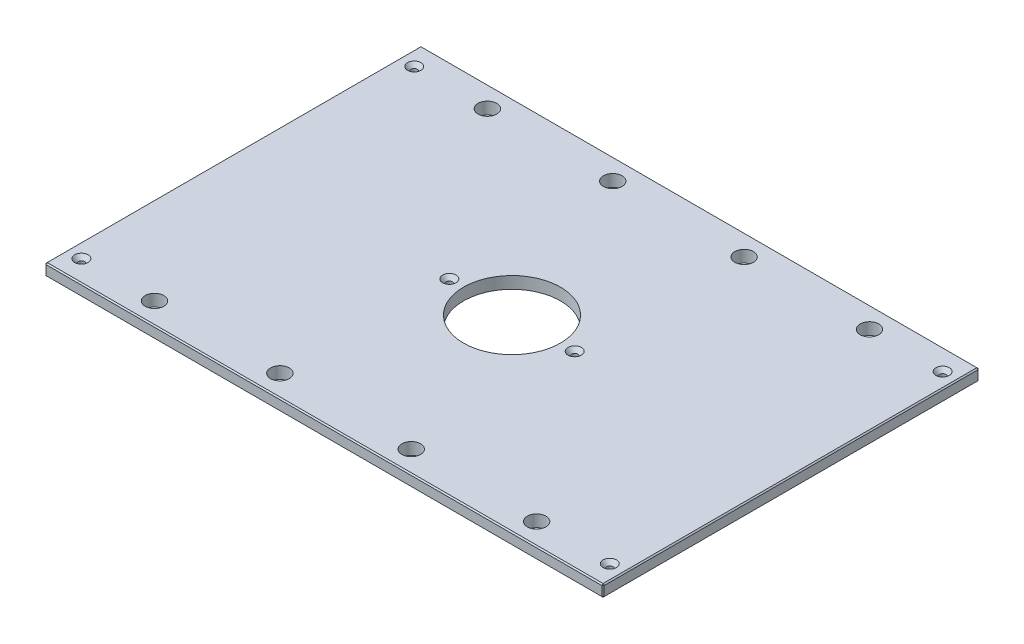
ISO-10303-21;
HEADER;
FILE_DESCRIPTION(('STEP AP214'),'2;1');
FILE_NAME('part.step','',(''),(''),'','','');
FILE_SCHEMA(('AUTOMOTIVE_DESIGN { 1 0 10303 214 1 1 1 1 }'));
ENDSEC;
DATA;
#1=APPLICATION_CONTEXT('core data for automotive mechanical design processes');
#2=APPLICATION_PROTOCOL_DEFINITION('international standard','automotive_design',2000,#1);
#3=PRODUCT_CONTEXT('',#1,'mechanical');
#4=PRODUCT('Part','Part','',(#3));
#5=PRODUCT_RELATED_PRODUCT_CATEGORY('part','',(#4));
#6=PRODUCT_DEFINITION_FORMATION('','',#4);
#7=PRODUCT_DEFINITION_CONTEXT('part definition',#1,'design');
#8=PRODUCT_DEFINITION('design','',#6,#7);
#9=PRODUCT_DEFINITION_SHAPE('','',#8);
#10=(LENGTH_UNIT() NAMED_UNIT(*) SI_UNIT(.MILLI.,.METRE.));
#11=(NAMED_UNIT(*) PLANE_ANGLE_UNIT() SI_UNIT($,.RADIAN.));
#12=(NAMED_UNIT(*) SI_UNIT($,.STERADIAN.) SOLID_ANGLE_UNIT());
#13=UNCERTAINTY_MEASURE_WITH_UNIT(LENGTH_MEASURE(1.E-05),#10,'distance_accuracy_value','');
#14=(GEOMETRIC_REPRESENTATION_CONTEXT(3) GLOBAL_UNCERTAINTY_ASSIGNED_CONTEXT((#13)) GLOBAL_UNIT_ASSIGNED_CONTEXT((#10,
#11,#12)) REPRESENTATION_CONTEXT('',''));
#15=CARTESIAN_POINT('',(0.,0.,0.));
#16=DIRECTION('',(0.,0.,1.));
#17=DIRECTION('',(1.,0.,0.));
#18=AXIS2_PLACEMENT_3D('',#15,#16,#17);
#19=CARTESIAN_POINT('',(-296.8625,12.7,-200.025));
#20=DIRECTION('',(1.,0.,0.));
#21=DIRECTION('',(0.,0.,-1.));
#22=AXIS2_PLACEMENT_3D('',#19,#20,#21);
#23=PLANE('',#22);
#24=DIRECTION('',(0.,0.,-1.));
#25=VECTOR('',#24,1.);
#26=CARTESIAN_POINT('',(-296.8625,11.4300000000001,-200.025));
#27=LINE('',#26,#25);
#28=CARTESIAN_POINT('',(-296.8625,11.4300000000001,198.755));
#29=VERTEX_POINT('',#28);
#30=CARTESIAN_POINT('',(-296.8625,11.4300000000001,-198.755));
#31=VERTEX_POINT('',#30);
#32=EDGE_CURVE('E135',#29,#31,#27,.T.);
#33=ORIENTED_EDGE('',*,*,#32,.T.);
#34=DIRECTION('',(0.,-1.,0.));
#35=VECTOR('',#34,1.);
#36=CARTESIAN_POINT('',(-296.8625,12.7,-198.755));
#37=LINE('',#36,#35);
#38=CARTESIAN_POINT('',(-296.8625,1.26999999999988,-198.755));
#39=VERTEX_POINT('',#38);
#40=EDGE_CURVE('E131',#31,#39,#37,.T.);
#41=ORIENTED_EDGE('',*,*,#40,.T.);
#42=DIRECTION('',(0.,0.,1.));
#43=VECTOR('',#42,1.);
#44=CARTESIAN_POINT('',(-296.8625,1.26999999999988,-200.025));
#45=LINE('',#44,#43);
#46=CARTESIAN_POINT('',(-296.8625,1.26999999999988,198.755));
#47=VERTEX_POINT('',#46);
#48=EDGE_CURVE('E126',#39,#47,#45,.T.);
#49=ORIENTED_EDGE('',*,*,#48,.T.);
#50=DIRECTION('',(0.,1.,0.));
#51=VECTOR('',#50,1.);
#52=CARTESIAN_POINT('',(-296.8625,12.7,198.755));
#53=LINE('',#52,#51);
#54=EDGE_CURVE('E128',#47,#29,#53,.T.);
#55=ORIENTED_EDGE('',*,*,#54,.T.);
#56=EDGE_LOOP('',(#33,#41,#49,#55));
#57=FACE_BOUND('',#56,.T.);
#58=ADVANCED_FACE('F35',(#57),#23,.F.);
#59=CARTESIAN_POINT('',(-296.8625,12.7,200.025));
#60=DIRECTION('',(0.,0.,-1.));
#61=DIRECTION('',(-1.,0.,0.));
#62=AXIS2_PLACEMENT_3D('',#59,#60,#61);
#63=PLANE('',#62);
#64=DIRECTION('',(1.,0.,0.));
#65=VECTOR('',#64,1.);
#66=CARTESIAN_POINT('',(-296.8625,1.26999999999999,200.025));
#67=LINE('',#66,#65);
#68=CARTESIAN_POINT('',(-295.5925,1.26999999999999,200.025));
#69=VERTEX_POINT('',#68);
#70=CARTESIAN_POINT('',(295.5925,1.26999999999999,200.025));
#71=VERTEX_POINT('',#70);
#72=EDGE_CURVE('E58',#69,#71,#67,.T.);
#73=ORIENTED_EDGE('',*,*,#72,.T.);
#74=DIRECTION('',(0.,1.,0.));
#75=VECTOR('',#74,1.);
#76=CARTESIAN_POINT('',(295.5925,12.7,200.025));
#77=LINE('',#76,#75);
#78=CARTESIAN_POINT('',(295.5925,11.43,200.025));
#79=VERTEX_POINT('',#78);
#80=EDGE_CURVE('E11',#71,#79,#77,.T.);
#81=ORIENTED_EDGE('',*,*,#80,.T.);
#82=DIRECTION('',(-1.,0.,0.));
#83=VECTOR('',#82,1.);
#84=CARTESIAN_POINT('',(-296.8625,11.43,200.025));
#85=LINE('',#84,#83);
#86=CARTESIAN_POINT('',(-295.5925,11.43,200.025));
#87=VERTEX_POINT('',#86);
#88=EDGE_CURVE('E44',#79,#87,#85,.T.);
#89=ORIENTED_EDGE('',*,*,#88,.T.);
#90=DIRECTION('',(0.,-1.,0.));
#91=VECTOR('',#90,1.);
#92=CARTESIAN_POINT('',(-295.5925,12.7,200.025));
#93=LINE('',#92,#91);
#94=EDGE_CURVE('E303',#87,#69,#93,.T.);
#95=ORIENTED_EDGE('',*,*,#94,.T.);
#96=EDGE_LOOP('',(#73,#81,#89,#95));
#97=FACE_BOUND('',#96,.T.);
#98=ADVANCED_FACE('F372',(#97),#63,.F.);
#99=CARTESIAN_POINT('',(296.8625,12.7,-200.025));
#100=DIRECTION('',(-1.,0.,0.));
#101=DIRECTION('',(0.,0.,1.));
#102=AXIS2_PLACEMENT_3D('',#99,#100,#101);
#103=PLANE('',#102);
#104=DIRECTION('',(0.,0.,-1.));
#105=VECTOR('',#104,1.);
#106=CARTESIAN_POINT('',(296.8625,1.26999999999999,-200.025));
#107=LINE('',#106,#105);
#108=CARTESIAN_POINT('',(296.8625,1.26999999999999,198.755));
#109=VERTEX_POINT('',#108);
#110=CARTESIAN_POINT('',(296.8625,1.26999999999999,-198.755));
#111=VERTEX_POINT('',#110);
#112=EDGE_CURVE('E298',#109,#111,#107,.T.);
#113=ORIENTED_EDGE('',*,*,#112,.T.);
#114=DIRECTION('',(0.,1.,0.));
#115=VECTOR('',#114,1.);
#116=CARTESIAN_POINT('',(296.8625,12.7,-198.755));
#117=LINE('',#116,#115);
#118=CARTESIAN_POINT('',(296.8625,11.4300000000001,-198.755));
#119=VERTEX_POINT('',#118);
#120=EDGE_CURVE('E300',#111,#119,#117,.T.);
#121=ORIENTED_EDGE('',*,*,#120,.T.);
#122=DIRECTION('',(0.,0.,1.));
#123=VECTOR('',#122,1.);
#124=CARTESIAN_POINT('',(296.8625,11.4300000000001,200.025));
#125=LINE('',#124,#123);
#126=CARTESIAN_POINT('',(296.8625,11.4300000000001,198.755));
#127=VERTEX_POINT('',#126);
#128=EDGE_CURVE('E296',#119,#127,#125,.T.);
#129=ORIENTED_EDGE('',*,*,#128,.T.);
#130=DIRECTION('',(0.,-1.,0.));
#131=VECTOR('',#130,1.);
#132=CARTESIAN_POINT('',(296.8625,12.7,198.755));
#133=LINE('',#132,#131);
#134=EDGE_CURVE('E294',#127,#109,#133,.T.);
#135=ORIENTED_EDGE('',*,*,#134,.T.);
#136=EDGE_LOOP('',(#113,#121,#129,#135));
#137=FACE_BOUND('',#136,.T.);
#138=ADVANCED_FACE('F359',(#137),#103,.F.);
#139=CARTESIAN_POINT('',(-296.8625,12.7,-200.025));
#140=DIRECTION('',(0.,0.,1.));
#141=DIRECTION('',(1.,0.,0.));
#142=AXIS2_PLACEMENT_3D('',#139,#140,#141);
#143=PLANE('',#142);
#144=DIRECTION('',(-1.,0.,0.));
#145=VECTOR('',#144,1.);
#146=CARTESIAN_POINT('',(-296.8625,1.26999999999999,-200.025));
#147=LINE('',#146,#145);
#148=CARTESIAN_POINT('',(295.5925,1.26999999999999,-200.025));
#149=VERTEX_POINT('',#148);
#150=CARTESIAN_POINT('',(-295.5925,1.26999999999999,-200.025));
#151=VERTEX_POINT('',#150);
#152=EDGE_CURVE('E270',#149,#151,#147,.T.);
#153=ORIENTED_EDGE('',*,*,#152,.T.);
#154=DIRECTION('',(0.,1.,0.));
#155=VECTOR('',#154,1.);
#156=CARTESIAN_POINT('',(-295.5925,12.7,-200.025));
#157=LINE('',#156,#155);
#158=CARTESIAN_POINT('',(-295.5925,11.4300000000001,-200.025));
#159=VERTEX_POINT('',#158);
#160=EDGE_CURVE('E274',#151,#159,#157,.T.);
#161=ORIENTED_EDGE('',*,*,#160,.T.);
#162=DIRECTION('',(1.,0.,0.));
#163=VECTOR('',#162,1.);
#164=CARTESIAN_POINT('',(296.8625,11.4300000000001,-200.025));
#165=LINE('',#164,#163);
#166=CARTESIAN_POINT('',(295.5925,11.4300000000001,-200.025));
#167=VERTEX_POINT('',#166);
#168=EDGE_CURVE('E272',#159,#167,#165,.T.);
#169=ORIENTED_EDGE('',*,*,#168,.T.);
#170=DIRECTION('',(0.,-1.,0.));
#171=VECTOR('',#170,1.);
#172=CARTESIAN_POINT('',(295.5925,12.7,-200.025));
#173=LINE('',#172,#171);
#174=EDGE_CURVE('E268',#167,#149,#173,.T.);
#175=ORIENTED_EDGE('',*,*,#174,.T.);
#176=EDGE_LOOP('',(#153,#161,#169,#175));
#177=FACE_BOUND('',#176,.T.);
#178=ADVANCED_FACE('F333',(#177),#143,.F.);
#179=CARTESIAN_POINT('',(0.,12.7,0.));
#180=DIRECTION('',(0.,1.,0.));
#181=DIRECTION('',(0.,0.,1.));
#182=AXIS2_PLACEMENT_3D('',#179,#180,#181);
#183=PLANE('',#182);
#184=CARTESIAN_POINT('',(280.9875,12.7,-177.00498));
#185=DIRECTION('',(0.,1.,0.));
#186=DIRECTION('',(0.,0.,1.));
#187=AXIS2_PLACEMENT_3D('',#184,#185,#186);
#188=CIRCLE('',#187,7.13740000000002);
#189=CARTESIAN_POINT('',(280.9875,12.7,-169.86758));
#190=VERTEX_POINT('',#189);
#191=EDGE_CURVE('E816',#190,#190,#188,.T.);
#192=ORIENTED_EDGE('',*,*,#191,.F.);
#193=EDGE_LOOP('',(#192));
#194=FACE_BOUND('',#193,.T.);
#195=CARTESIAN_POINT('',(280.9875,12.7,177.00498));
#196=DIRECTION('',(0.,1.,0.));
#197=DIRECTION('',(0.,0.,1.));
#198=AXIS2_PLACEMENT_3D('',#195,#196,#197);
#199=CIRCLE('',#198,7.13740000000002);
#200=CARTESIAN_POINT('',(280.9875,12.7,184.14238));
#201=VERTEX_POINT('',#200);
#202=EDGE_CURVE('E820',#201,#201,#199,.T.);
#203=ORIENTED_EDGE('',*,*,#202,.F.);
#204=EDGE_LOOP('',(#203));
#205=FACE_BOUND('',#204,.T.);
#206=CARTESIAN_POINT('',(-280.9875,12.7,177.00498));
#207=DIRECTION('',(0.,1.,0.));
#208=DIRECTION('',(0.,0.,1.));
#209=AXIS2_PLACEMENT_3D('',#206,#207,#208);
#210=CIRCLE('',#209,7.13740000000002);
#211=CARTESIAN_POINT('',(-280.9875,12.7,184.14238));
#212=VERTEX_POINT('',#211);
#213=EDGE_CURVE('E824',#212,#212,#210,.T.);
#214=ORIENTED_EDGE('',*,*,#213,.F.);
#215=EDGE_LOOP('',(#214));
#216=FACE_BOUND('',#215,.T.);
#217=CARTESIAN_POINT('',(-66.675,12.7,0.));
#218=DIRECTION('',(0.,1.,0.));
#219=DIRECTION('',(0.,0.,1.));
#220=AXIS2_PLACEMENT_3D('',#217,#218,#219);
#221=CIRCLE('',#220,7.1374);
#222=CARTESIAN_POINT('',(-66.675,12.7,7.1374));
#223=VERTEX_POINT('',#222);
#224=EDGE_CURVE('E828',#223,#223,#221,.T.);
#225=ORIENTED_EDGE('',*,*,#224,.F.);
#226=EDGE_LOOP('',(#225));
#227=FACE_BOUND('',#226,.T.);
#228=CARTESIAN_POINT('',(66.675,12.7,0.));
#229=DIRECTION('',(0.,1.,0.));
#230=DIRECTION('',(0.,0.,1.));
#231=AXIS2_PLACEMENT_3D('',#228,#229,#230);
#232=CIRCLE('',#231,7.1374);
#233=CARTESIAN_POINT('',(66.675,12.7,7.1374));
#234=VERTEX_POINT('',#233);
#235=EDGE_CURVE('E832',#234,#234,#232,.T.);
#236=ORIENTED_EDGE('',*,*,#235,.F.);
#237=EDGE_LOOP('',(#236));
#238=FACE_BOUND('',#237,.T.);
#239=CARTESIAN_POINT('',(-280.9875,12.7,-177.00498));
#240=DIRECTION('',(0.,1.,0.));
#241=DIRECTION('',(0.,0.,1.));
#242=AXIS2_PLACEMENT_3D('',#239,#240,#241);
#243=CIRCLE('',#242,7.13740000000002);
#244=CARTESIAN_POINT('',(-280.9875,12.7,-169.86758));
#245=VERTEX_POINT('',#244);
#246=EDGE_CURVE('E835',#245,#245,#243,.T.);
#247=ORIENTED_EDGE('',*,*,#246,.F.);
#248=EDGE_LOOP('',(#247));
#249=FACE_BOUND('',#248,.T.);
#250=DIRECTION('',(0.,0.,-1.));
#251=VECTOR('',#250,1.);
#252=CARTESIAN_POINT('',(295.5925,12.7,-200.025));
#253=LINE('',#252,#251);
#254=CARTESIAN_POINT('',(295.5925,12.7,198.755));
#255=VERTEX_POINT('',#254);
#256=CARTESIAN_POINT('',(295.5925,12.7,-198.755));
#257=VERTEX_POINT('',#256);
#258=EDGE_CURVE('E281',#255,#257,#253,.T.);
#259=ORIENTED_EDGE('',*,*,#258,.T.);
#260=DIRECTION('',(-1.,0.,0.));
#261=VECTOR('',#260,1.);
#262=CARTESIAN_POINT('',(-296.8625,12.7,-198.755));
#263=LINE('',#262,#261);
#264=CARTESIAN_POINT('',(-295.5925,12.7,-198.755));
#265=VERTEX_POINT('',#264);
#266=EDGE_CURVE('E283',#257,#265,#263,.T.);
#267=ORIENTED_EDGE('',*,*,#266,.T.);
#268=DIRECTION('',(0.,0.,1.));
#269=VECTOR('',#268,1.);
#270=CARTESIAN_POINT('',(-295.5925,12.7,200.025));
#271=LINE('',#270,#269);
#272=CARTESIAN_POINT('',(-295.5925,12.7,198.755));
#273=VERTEX_POINT('',#272);
#274=EDGE_CURVE('E279',#265,#273,#271,.T.);
#275=ORIENTED_EDGE('',*,*,#274,.T.);
#276=DIRECTION('',(1.,0.,0.));
#277=VECTOR('',#276,1.);
#278=CARTESIAN_POINT('',(296.8625,12.7,198.755));
#279=LINE('',#278,#277);
#280=EDGE_CURVE('E277',#273,#255,#279,.T.);
#281=ORIENTED_EDGE('',*,*,#280,.T.);
#282=EDGE_LOOP('',(#259,#267,#275,#281));
#283=FACE_BOUND('',#282,.T.);
#284=CARTESIAN_POINT('',(203.2,12.7,-177.00498));
#285=DIRECTION('',(0.,1.,0.));
#286=DIRECTION('',(0.,0.,1.));
#287=AXIS2_PLACEMENT_3D('',#284,#285,#286);
#288=CIRCLE('',#287,9.921875);
#289=CARTESIAN_POINT('',(203.2,12.7,-167.083105));
#290=VERTEX_POINT('',#289);
#291=EDGE_CURVE('E204',#290,#290,#288,.T.);
#292=ORIENTED_EDGE('',*,*,#291,.F.);
#293=EDGE_LOOP('',(#292));
#294=FACE_BOUND('',#293,.T.);
#295=CARTESIAN_POINT('',(-203.2,12.7,-177.00498));
#296=DIRECTION('',(0.,1.,0.));
#297=DIRECTION('',(0.,0.,1.));
#298=AXIS2_PLACEMENT_3D('',#295,#296,#297);
#299=CIRCLE('',#298,9.921875);
#300=CARTESIAN_POINT('',(-203.2,12.7,-167.083105));
#301=VERTEX_POINT('',#300);
#302=EDGE_CURVE('E214',#301,#301,#299,.T.);
#303=ORIENTED_EDGE('',*,*,#302,.F.);
#304=EDGE_LOOP('',(#303));
#305=FACE_BOUND('',#304,.T.);
#306=CARTESIAN_POINT('',(203.2,12.7,177.00498));
#307=DIRECTION('',(0.,1.,0.));
#308=DIRECTION('',(0.,0.,1.));
#309=AXIS2_PLACEMENT_3D('',#306,#307,#308);
#310=CIRCLE('',#309,9.921875);
#311=CARTESIAN_POINT('',(203.2,12.7,186.926855));
#312=VERTEX_POINT('',#311);
#313=EDGE_CURVE('E225',#312,#312,#310,.T.);
#314=ORIENTED_EDGE('',*,*,#313,.F.);
#315=EDGE_LOOP('',(#314));
#316=FACE_BOUND('',#315,.T.);
#317=CARTESIAN_POINT('',(-203.2,12.7,177.00498));
#318=DIRECTION('',(0.,1.,0.));
#319=DIRECTION('',(0.,0.,1.));
#320=AXIS2_PLACEMENT_3D('',#317,#318,#319);
#321=CIRCLE('',#320,9.921875);
#322=CARTESIAN_POINT('',(-203.2,12.7,186.926855));
#323=VERTEX_POINT('',#322);
#324=EDGE_CURVE('E231',#323,#323,#321,.T.);
#325=ORIENTED_EDGE('',*,*,#324,.F.);
#326=EDGE_LOOP('',(#325));
#327=FACE_BOUND('',#326,.T.);
#328=CARTESIAN_POINT('',(-69.85,12.7,-177.00498));
#329=DIRECTION('',(0.,1.,0.));
#330=DIRECTION('',(0.,0.,1.));
#331=AXIS2_PLACEMENT_3D('',#328,#329,#330);
#332=CIRCLE('',#331,9.921875);
#333=CARTESIAN_POINT('',(-69.85,12.7,-167.083105));
#334=VERTEX_POINT('',#333);
#335=EDGE_CURVE('E237',#334,#334,#332,.T.);
#336=ORIENTED_EDGE('',*,*,#335,.F.);
#337=EDGE_LOOP('',(#336));
#338=FACE_BOUND('',#337,.T.);
#339=CARTESIAN_POINT('',(69.85,12.7,-177.00498));
#340=DIRECTION('',(0.,1.,0.));
#341=DIRECTION('',(0.,0.,1.));
#342=AXIS2_PLACEMENT_3D('',#339,#340,#341);
#343=CIRCLE('',#342,9.921875);
#344=CARTESIAN_POINT('',(69.85,12.7,-167.083105));
#345=VERTEX_POINT('',#344);
#346=EDGE_CURVE('E243',#345,#345,#343,.T.);
#347=ORIENTED_EDGE('',*,*,#346,.F.);
#348=EDGE_LOOP('',(#347));
#349=FACE_BOUND('',#348,.T.);
#350=CARTESIAN_POINT('',(69.85,12.7,177.00498));
#351=DIRECTION('',(0.,1.,0.));
#352=DIRECTION('',(0.,0.,1.));
#353=AXIS2_PLACEMENT_3D('',#350,#351,#352);
#354=CIRCLE('',#353,9.921875);
#355=CARTESIAN_POINT('',(69.85,12.7,186.926855));
#356=VERTEX_POINT('',#355);
#357=EDGE_CURVE('E249',#356,#356,#354,.T.);
#358=ORIENTED_EDGE('',*,*,#357,.F.);
#359=EDGE_LOOP('',(#358));
#360=FACE_BOUND('',#359,.T.);
#361=CARTESIAN_POINT('',(-69.85,12.7,177.00498));
#362=DIRECTION('',(0.,1.,0.));
#363=DIRECTION('',(0.,0.,1.));
#364=AXIS2_PLACEMENT_3D('',#361,#362,#363);
#365=CIRCLE('',#364,9.921875);
#366=CARTESIAN_POINT('',(-69.85,12.7,186.926855));
#367=VERTEX_POINT('',#366);
#368=EDGE_CURVE('E255',#367,#367,#365,.T.);
#369=ORIENTED_EDGE('',*,*,#368,.F.);
#370=EDGE_LOOP('',(#369));
#371=FACE_BOUND('',#370,.T.);
#372=CARTESIAN_POINT('',(0.,12.7,0.));
#373=DIRECTION('',(0.,1.,0.));
#374=DIRECTION('',(0.,0.,1.));
#375=AXIS2_PLACEMENT_3D('',#372,#373,#374);
#376=CIRCLE('',#375,51.562);
#377=CARTESIAN_POINT('',(0.,12.7,51.562));
#378=VERTEX_POINT('',#377);
#379=EDGE_CURVE('E261',#378,#378,#376,.T.);
#380=ORIENTED_EDGE('',*,*,#379,.F.);
#381=EDGE_LOOP('',(#380));
#382=FACE_BOUND('',#381,.T.);
#383=ADVANCED_FACE('F381',(#194,#205,#216,#227,#238,#249,#283,#294,#305,#316,#327,#338,#349,
#360,#371,#382),#183,.T.);
#384=CARTESIAN_POINT('',(0.,0.,0.));
#385=DIRECTION('',(0.,1.,0.));
#386=DIRECTION('',(0.,0.,1.));
#387=AXIS2_PLACEMENT_3D('',#384,#385,#386);
#388=PLANE('',#387);
#389=CARTESIAN_POINT('',(280.9875,0.,-177.00498));
#390=DIRECTION('',(0.,1.,0.));
#391=DIRECTION('',(0.,0.,1.));
#392=AXIS2_PLACEMENT_3D('',#389,#390,#391);
#393=CIRCLE('',#392,3.3782);
#394=CARTESIAN_POINT('',(280.9875,0.,-173.62678));
#395=VERTEX_POINT('',#394);
#396=EDGE_CURVE('E869',#395,#395,#393,.T.);
#397=ORIENTED_EDGE('',*,*,#396,.T.);
#398=EDGE_LOOP('',(#397));
#399=FACE_BOUND('',#398,.T.);
#400=CARTESIAN_POINT('',(280.9875,0.,177.00498));
#401=DIRECTION('',(0.,1.,0.));
#402=DIRECTION('',(0.,0.,1.));
#403=AXIS2_PLACEMENT_3D('',#400,#401,#402);
#404=CIRCLE('',#403,3.3782);
#405=CARTESIAN_POINT('',(280.9875,0.,180.38318));
#406=VERTEX_POINT('',#405);
#407=EDGE_CURVE('E862',#406,#406,#404,.T.);
#408=ORIENTED_EDGE('',*,*,#407,.T.);
#409=EDGE_LOOP('',(#408));
#410=FACE_BOUND('',#409,.T.);
#411=CARTESIAN_POINT('',(-280.9875,0.,177.00498));
#412=DIRECTION('',(0.,1.,0.));
#413=DIRECTION('',(0.,0.,1.));
#414=AXIS2_PLACEMENT_3D('',#411,#412,#413);
#415=CIRCLE('',#414,3.3782);
#416=CARTESIAN_POINT('',(-280.9875,0.,180.38318));
#417=VERTEX_POINT('',#416);
#418=EDGE_CURVE('E855',#417,#417,#415,.T.);
#419=ORIENTED_EDGE('',*,*,#418,.T.);
#420=EDGE_LOOP('',(#419));
#421=FACE_BOUND('',#420,.T.);
#422=CARTESIAN_POINT('',(-66.675,0.,0.));
#423=DIRECTION('',(0.,1.,0.));
#424=DIRECTION('',(0.,0.,1.));
#425=AXIS2_PLACEMENT_3D('',#422,#423,#424);
#426=CIRCLE('',#425,3.3782);
#427=CARTESIAN_POINT('',(-66.675,0.,3.3782));
#428=VERTEX_POINT('',#427);
#429=EDGE_CURVE('E848',#428,#428,#426,.T.);
#430=ORIENTED_EDGE('',*,*,#429,.T.);
#431=EDGE_LOOP('',(#430));
#432=FACE_BOUND('',#431,.T.);
#433=CARTESIAN_POINT('',(66.675,0.,0.));
#434=DIRECTION('',(0.,1.,0.));
#435=DIRECTION('',(0.,0.,1.));
#436=AXIS2_PLACEMENT_3D('',#433,#434,#435);
#437=CIRCLE('',#436,3.3782);
#438=CARTESIAN_POINT('',(66.675,0.,3.3782));
#439=VERTEX_POINT('',#438);
#440=EDGE_CURVE('E838',#439,#439,#437,.T.);
#441=ORIENTED_EDGE('',*,*,#440,.T.);
#442=EDGE_LOOP('',(#441));
#443=FACE_BOUND('',#442,.T.);
#444=CARTESIAN_POINT('',(-280.9875,0.,-177.00498));
#445=DIRECTION('',(0.,1.,0.));
#446=DIRECTION('',(0.,0.,1.));
#447=AXIS2_PLACEMENT_3D('',#444,#445,#446);
#448=CIRCLE('',#447,3.3782);
#449=CARTESIAN_POINT('',(-280.9875,0.,-173.62678));
#450=VERTEX_POINT('',#449);
#451=EDGE_CURVE('E217',#450,#450,#448,.T.);
#452=ORIENTED_EDGE('',*,*,#451,.T.);
#453=EDGE_LOOP('',(#452));
#454=FACE_BOUND('',#453,.T.);
#455=DIRECTION('',(0.,0.,-1.));
#456=VECTOR('',#455,1.);
#457=CARTESIAN_POINT('',(-295.5925,0.,0.));
#458=LINE('',#457,#456);
#459=CARTESIAN_POINT('',(-295.5925,0.,198.755));
#460=VERTEX_POINT('',#459);
#461=CARTESIAN_POINT('',(-295.5925,0.,-198.755));
#462=VERTEX_POINT('',#461);
#463=EDGE_CURVE('E158',#460,#462,#458,.T.);
#464=ORIENTED_EDGE('',*,*,#463,.T.);
#465=DIRECTION('',(1.,0.,0.));
#466=VECTOR('',#465,1.);
#467=CARTESIAN_POINT('',(0.,0.,-198.755));
#468=LINE('',#467,#466);
#469=CARTESIAN_POINT('',(295.5925,0.,-198.755));
#470=VERTEX_POINT('',#469);
#471=EDGE_CURVE('E291',#462,#470,#468,.T.);
#472=ORIENTED_EDGE('',*,*,#471,.T.);
#473=DIRECTION('',(0.,0.,1.));
#474=VECTOR('',#473,1.);
#475=CARTESIAN_POINT('',(295.5925,0.,0.));
#476=LINE('',#475,#474);
#477=CARTESIAN_POINT('',(295.5925,0.,198.755));
#478=VERTEX_POINT('',#477);
#479=EDGE_CURVE('E289',#470,#478,#476,.T.);
#480=ORIENTED_EDGE('',*,*,#479,.T.);
#481=DIRECTION('',(-1.,0.,0.));
#482=VECTOR('',#481,1.);
#483=CARTESIAN_POINT('',(0.,0.,198.755));
#484=LINE('',#483,#482);
#485=EDGE_CURVE('E286',#478,#460,#484,.T.);
#486=ORIENTED_EDGE('',*,*,#485,.T.);
#487=EDGE_LOOP('',(#464,#472,#480,#486));
#488=FACE_BOUND('',#487,.T.);
#489=CARTESIAN_POINT('',(203.2,0.,-177.00498));
#490=DIRECTION('',(0.,1.,0.));
#491=DIRECTION('',(0.,0.,1.));
#492=AXIS2_PLACEMENT_3D('',#489,#490,#491);
#493=CIRCLE('',#492,9.921875);
#494=CARTESIAN_POINT('',(203.2,0.,-167.083105));
#495=VERTEX_POINT('',#494);
#496=EDGE_CURVE('E209',#495,#495,#493,.T.);
#497=ORIENTED_EDGE('',*,*,#496,.T.);
#498=EDGE_LOOP('',(#497));
#499=FACE_BOUND('',#498,.T.);
#500=CARTESIAN_POINT('',(-203.2,0.,-177.00498));
#501=DIRECTION('',(0.,1.,0.));
#502=DIRECTION('',(0.,0.,1.));
#503=AXIS2_PLACEMENT_3D('',#500,#501,#502);
#504=CIRCLE('',#503,9.921875);
#505=CARTESIAN_POINT('',(-203.2,0.,-167.083105));
#506=VERTEX_POINT('',#505);
#507=EDGE_CURVE('E222',#506,#506,#504,.T.);
#508=ORIENTED_EDGE('',*,*,#507,.T.);
#509=EDGE_LOOP('',(#508));
#510=FACE_BOUND('',#509,.T.);
#511=CARTESIAN_POINT('',(203.2,0.,177.00498));
#512=DIRECTION('',(0.,1.,0.));
#513=DIRECTION('',(0.,0.,1.));
#514=AXIS2_PLACEMENT_3D('',#511,#512,#513);
#515=CIRCLE('',#514,9.921875);
#516=CARTESIAN_POINT('',(203.2,0.,186.926855));
#517=VERTEX_POINT('',#516);
#518=EDGE_CURVE('E228',#517,#517,#515,.T.);
#519=ORIENTED_EDGE('',*,*,#518,.T.);
#520=EDGE_LOOP('',(#519));
#521=FACE_BOUND('',#520,.T.);
#522=CARTESIAN_POINT('',(-203.2,0.,177.00498));
#523=DIRECTION('',(0.,1.,0.));
#524=DIRECTION('',(0.,0.,1.));
#525=AXIS2_PLACEMENT_3D('',#522,#523,#524);
#526=CIRCLE('',#525,9.921875);
#527=CARTESIAN_POINT('',(-203.2,0.,186.926855));
#528=VERTEX_POINT('',#527);
#529=EDGE_CURVE('E234',#528,#528,#526,.T.);
#530=ORIENTED_EDGE('',*,*,#529,.T.);
#531=EDGE_LOOP('',(#530));
#532=FACE_BOUND('',#531,.T.);
#533=CARTESIAN_POINT('',(-69.85,0.,-177.00498));
#534=DIRECTION('',(0.,1.,0.));
#535=DIRECTION('',(0.,0.,1.));
#536=AXIS2_PLACEMENT_3D('',#533,#534,#535);
#537=CIRCLE('',#536,9.921875);
#538=CARTESIAN_POINT('',(-69.85,0.,-167.083105));
#539=VERTEX_POINT('',#538);
#540=EDGE_CURVE('E240',#539,#539,#537,.T.);
#541=ORIENTED_EDGE('',*,*,#540,.T.);
#542=EDGE_LOOP('',(#541));
#543=FACE_BOUND('',#542,.T.);
#544=CARTESIAN_POINT('',(69.85,0.,-177.00498));
#545=DIRECTION('',(0.,1.,0.));
#546=DIRECTION('',(0.,0.,1.));
#547=AXIS2_PLACEMENT_3D('',#544,#545,#546);
#548=CIRCLE('',#547,9.921875);
#549=CARTESIAN_POINT('',(69.85,0.,-167.083105));
#550=VERTEX_POINT('',#549);
#551=EDGE_CURVE('E246',#550,#550,#548,.T.);
#552=ORIENTED_EDGE('',*,*,#551,.T.);
#553=EDGE_LOOP('',(#552));
#554=FACE_BOUND('',#553,.T.);
#555=CARTESIAN_POINT('',(69.85,0.,177.00498));
#556=DIRECTION('',(0.,1.,0.));
#557=DIRECTION('',(0.,0.,1.));
#558=AXIS2_PLACEMENT_3D('',#555,#556,#557);
#559=CIRCLE('',#558,9.921875);
#560=CARTESIAN_POINT('',(69.85,0.,186.926855));
#561=VERTEX_POINT('',#560);
#562=EDGE_CURVE('E252',#561,#561,#559,.T.);
#563=ORIENTED_EDGE('',*,*,#562,.T.);
#564=EDGE_LOOP('',(#563));
#565=FACE_BOUND('',#564,.T.);
#566=CARTESIAN_POINT('',(-69.85,0.,177.00498));
#567=DIRECTION('',(0.,1.,0.));
#568=DIRECTION('',(0.,0.,1.));
#569=AXIS2_PLACEMENT_3D('',#566,#567,#568);
#570=CIRCLE('',#569,9.921875);
#571=CARTESIAN_POINT('',(-69.85,0.,186.926855));
#572=VERTEX_POINT('',#571);
#573=EDGE_CURVE('E258',#572,#572,#570,.T.);
#574=ORIENTED_EDGE('',*,*,#573,.T.);
#575=EDGE_LOOP('',(#574));
#576=FACE_BOUND('',#575,.T.);
#577=CARTESIAN_POINT('',(0.,0.,0.));
#578=DIRECTION('',(0.,1.,0.));
#579=DIRECTION('',(0.,0.,1.));
#580=AXIS2_PLACEMENT_3D('',#577,#578,#579);
#581=CIRCLE('',#580,51.562);
#582=CARTESIAN_POINT('',(0.,0.,51.562));
#583=VERTEX_POINT('',#582);
#584=EDGE_CURVE('E147',#583,#583,#581,.T.);
#585=ORIENTED_EDGE('',*,*,#584,.T.);
#586=EDGE_LOOP('',(#585));
#587=FACE_BOUND('',#586,.T.);
#588=ADVANCED_FACE('F346',(#399,#410,#421,#432,#443,#454,#488,#499,#510,#521,#532,#543,#554,
#565,#576,#587),#388,.F.);
#589=CARTESIAN_POINT('',(0.,0.,0.));
#590=DIRECTION('',(0.,1.,0.));
#591=DIRECTION('',(0.,0.,1.));
#592=AXIS2_PLACEMENT_3D('',#589,#590,#591);
#593=CYLINDRICAL_SURFACE('',#592,51.562);
#594=ORIENTED_EDGE('',*,*,#584,.F.);
#595=EDGE_LOOP('',(#594));
#596=FACE_BOUND('',#595,.T.);
#597=ORIENTED_EDGE('',*,*,#379,.T.);
#598=EDGE_LOOP('',(#597));
#599=FACE_BOUND('',#598,.T.);
#600=ADVANCED_FACE('F751',(#596,#599),#593,.F.);
#601=CARTESIAN_POINT('',(-69.85,12.7,177.00498));
#602=DIRECTION('',(0.,1.,0.));
#603=DIRECTION('',(0.,0.,1.));
#604=AXIS2_PLACEMENT_3D('',#601,#602,#603);
#605=CYLINDRICAL_SURFACE('',#604,9.921875);
#606=ORIENTED_EDGE('',*,*,#573,.F.);
#607=EDGE_LOOP('',(#606));
#608=FACE_BOUND('',#607,.T.);
#609=ORIENTED_EDGE('',*,*,#368,.T.);
#610=EDGE_LOOP('',(#609));
#611=FACE_BOUND('',#610,.T.);
#612=ADVANCED_FACE('F742',(#608,#611),#605,.F.);
#613=CARTESIAN_POINT('',(69.85,12.7,177.00498));
#614=DIRECTION('',(0.,1.,0.));
#615=DIRECTION('',(0.,0.,1.));
#616=AXIS2_PLACEMENT_3D('',#613,#614,#615);
#617=CYLINDRICAL_SURFACE('',#616,9.921875);
#618=ORIENTED_EDGE('',*,*,#562,.F.);
#619=EDGE_LOOP('',(#618));
#620=FACE_BOUND('',#619,.T.);
#621=ORIENTED_EDGE('',*,*,#357,.T.);
#622=EDGE_LOOP('',(#621));
#623=FACE_BOUND('',#622,.T.);
#624=ADVANCED_FACE('F733',(#620,#623),#617,.F.);
#625=CARTESIAN_POINT('',(69.85,12.7,-177.00498));
#626=DIRECTION('',(0.,1.,0.));
#627=DIRECTION('',(0.,0.,1.));
#628=AXIS2_PLACEMENT_3D('',#625,#626,#627);
#629=CYLINDRICAL_SURFACE('',#628,9.921875);
#630=ORIENTED_EDGE('',*,*,#551,.F.);
#631=EDGE_LOOP('',(#630));
#632=FACE_BOUND('',#631,.T.);
#633=ORIENTED_EDGE('',*,*,#346,.T.);
#634=EDGE_LOOP('',(#633));
#635=FACE_BOUND('',#634,.T.);
#636=ADVANCED_FACE('F724',(#632,#635),#629,.F.);
#637=CARTESIAN_POINT('',(-69.85,12.7,-177.00498));
#638=DIRECTION('',(0.,1.,0.));
#639=DIRECTION('',(0.,0.,1.));
#640=AXIS2_PLACEMENT_3D('',#637,#638,#639);
#641=CYLINDRICAL_SURFACE('',#640,9.921875);
#642=ORIENTED_EDGE('',*,*,#540,.F.);
#643=EDGE_LOOP('',(#642));
#644=FACE_BOUND('',#643,.T.);
#645=ORIENTED_EDGE('',*,*,#335,.T.);
#646=EDGE_LOOP('',(#645));
#647=FACE_BOUND('',#646,.T.);
#648=ADVANCED_FACE('F715',(#644,#647),#641,.F.);
#649=CARTESIAN_POINT('',(-203.2,12.7,177.00498));
#650=DIRECTION('',(0.,1.,0.));
#651=DIRECTION('',(0.,0.,1.));
#652=AXIS2_PLACEMENT_3D('',#649,#650,#651);
#653=CYLINDRICAL_SURFACE('',#652,9.921875);
#654=ORIENTED_EDGE('',*,*,#529,.F.);
#655=EDGE_LOOP('',(#654));
#656=FACE_BOUND('',#655,.T.);
#657=ORIENTED_EDGE('',*,*,#324,.T.);
#658=EDGE_LOOP('',(#657));
#659=FACE_BOUND('',#658,.T.);
#660=ADVANCED_FACE('F706',(#656,#659),#653,.F.);
#661=CARTESIAN_POINT('',(203.2,12.7,177.00498));
#662=DIRECTION('',(0.,1.,0.));
#663=DIRECTION('',(0.,0.,1.));
#664=AXIS2_PLACEMENT_3D('',#661,#662,#663);
#665=CYLINDRICAL_SURFACE('',#664,9.921875);
#666=ORIENTED_EDGE('',*,*,#518,.F.);
#667=EDGE_LOOP('',(#666));
#668=FACE_BOUND('',#667,.T.);
#669=ORIENTED_EDGE('',*,*,#313,.T.);
#670=EDGE_LOOP('',(#669));
#671=FACE_BOUND('',#670,.T.);
#672=ADVANCED_FACE('F697',(#668,#671),#665,.F.);
#673=CARTESIAN_POINT('',(-203.2,12.7,-177.00498));
#674=DIRECTION('',(0.,1.,0.));
#675=DIRECTION('',(0.,0.,1.));
#676=AXIS2_PLACEMENT_3D('',#673,#674,#675);
#677=CYLINDRICAL_SURFACE('',#676,9.921875);
#678=ORIENTED_EDGE('',*,*,#507,.F.);
#679=EDGE_LOOP('',(#678));
#680=FACE_BOUND('',#679,.T.);
#681=ORIENTED_EDGE('',*,*,#302,.T.);
#682=EDGE_LOOP('',(#681));
#683=FACE_BOUND('',#682,.T.);
#684=ADVANCED_FACE('F687',(#680,#683),#677,.F.);
#685=CARTESIAN_POINT('',(203.2,12.7,-177.00498));
#686=DIRECTION('',(0.,1.,0.));
#687=DIRECTION('',(0.,0.,1.));
#688=AXIS2_PLACEMENT_3D('',#685,#686,#687);
#689=CYLINDRICAL_SURFACE('',#688,9.921875);
#690=ORIENTED_EDGE('',*,*,#496,.F.);
#691=EDGE_LOOP('',(#690));
#692=FACE_BOUND('',#691,.T.);
#693=ORIENTED_EDGE('',*,*,#291,.T.);
#694=EDGE_LOOP('',(#693));
#695=FACE_BOUND('',#694,.T.);
#696=ADVANCED_FACE('F390',(#692,#695),#689,.F.);
#697=CARTESIAN_POINT('',(296.8625,12.7,198.755));
#698=DIRECTION('',(-0.707106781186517,0.,-0.707106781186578));
#699=DIRECTION('',(0.,-1.,0.));
#700=AXIS2_PLACEMENT_3D('',#697,#698,#699);
#701=PLANE('',#700);
#702=DIRECTION('',(-0.707106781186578,0.,0.707106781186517));
#703=VECTOR('',#702,1.);
#704=CARTESIAN_POINT('',(296.8625,11.4300000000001,198.755));
#705=LINE('',#704,#703);
#706=EDGE_CURVE('E39',#79,#127,#705,.F.);
#707=ORIENTED_EDGE('',*,*,#706,.F.);
#708=ORIENTED_EDGE('',*,*,#80,.F.);
#709=DIRECTION('',(0.707106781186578,0.,-0.707106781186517));
#710=VECTOR('',#709,1.);
#711=CARTESIAN_POINT('',(296.2275,1.26999999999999,199.39));
#712=LINE('',#711,#710);
#713=EDGE_CURVE('E197',#109,#71,#712,.F.);
#714=ORIENTED_EDGE('',*,*,#713,.F.);
#715=ORIENTED_EDGE('',*,*,#134,.F.);
#716=EDGE_LOOP('',(#707,#708,#714,#715));
#717=FACE_BOUND('',#716,.T.);
#718=ADVANCED_FACE('F37',(#717),#701,.F.);
#719=CARTESIAN_POINT('',(296.8625,11.4300000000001,198.755));
#720=DIRECTION('',(0.577350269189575,0.577350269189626,0.577350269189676));
#721=DIRECTION('',(0.,-0.707106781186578,0.707106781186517));
#722=AXIS2_PLACEMENT_3D('',#719,#720,#721);
#723=PLANE('',#722);
#724=DIRECTION('',(0.,-0.707106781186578,0.707106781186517));
#725=VECTOR('',#724,1.);
#726=CARTESIAN_POINT('',(295.5925,12.065,199.39));
#727=LINE('',#726,#725);
#728=EDGE_CURVE('E193',#79,#255,#727,.F.);
#729=ORIENTED_EDGE('',*,*,#728,.F.);
#730=ORIENTED_EDGE('',*,*,#706,.T.);
#731=DIRECTION('',(-0.707106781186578,0.707106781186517,0.));
#732=VECTOR('',#731,1.);
#733=CARTESIAN_POINT('',(296.8625,11.4300000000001,198.755));
#734=LINE('',#733,#732);
#735=EDGE_CURVE('E195',#255,#127,#734,.F.);
#736=ORIENTED_EDGE('',*,*,#735,.F.);
#737=EDGE_LOOP('',(#729,#730,#736));
#738=FACE_BOUND('',#737,.T.);
#739=ADVANCED_FACE('F383',(#738),#723,.T.);
#740=CARTESIAN_POINT('',(295.5925,0.,198.755));
#741=DIRECTION('',(0.577350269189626,-0.577350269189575,0.577350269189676));
#742=DIRECTION('',(0.707106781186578,0.,-0.707106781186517));
#743=AXIS2_PLACEMENT_3D('',#740,#741,#742);
#744=PLANE('',#743);
#745=DIRECTION('',(-0.707106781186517,-0.707106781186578,0.));
#746=VECTOR('',#745,1.);
#747=CARTESIAN_POINT('',(295.5925,0.,198.755));
#748=LINE('',#747,#746);
#749=EDGE_CURVE('E187',#109,#478,#748,.T.);
#750=ORIENTED_EDGE('',*,*,#749,.F.);
#751=ORIENTED_EDGE('',*,*,#713,.T.);
#752=DIRECTION('',(0.,0.707106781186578,0.707106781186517));
#753=VECTOR('',#752,1.);
#754=CARTESIAN_POINT('',(295.5925,0.,198.755));
#755=LINE('',#754,#753);
#756=EDGE_CURVE('E190',#478,#71,#755,.T.);
#757=ORIENTED_EDGE('',*,*,#756,.F.);
#758=EDGE_LOOP('',(#750,#751,#757));
#759=FACE_BOUND('',#758,.T.);
#760=ADVANCED_FACE('F352',(#759),#744,.T.);
#761=CARTESIAN_POINT('',(295.5925,12.7,0.));
#762=DIRECTION('',(0.707106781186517,0.707106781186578,0.));
#763=DIRECTION('',(0.,0.,1.));
#764=AXIS2_PLACEMENT_3D('',#761,#762,#763);
#765=PLANE('',#764);
#766=ORIENTED_EDGE('',*,*,#735,.T.);
#767=ORIENTED_EDGE('',*,*,#128,.F.);
#768=DIRECTION('',(0.707106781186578,-0.707106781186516,0.));
#769=VECTOR('',#768,1.);
#770=CARTESIAN_POINT('',(296.2275,12.0650000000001,-198.755));
#771=LINE('',#770,#769);
#772=EDGE_CURVE('E182',#257,#119,#771,.T.);
#773=ORIENTED_EDGE('',*,*,#772,.F.);
#774=ORIENTED_EDGE('',*,*,#258,.F.);
#775=EDGE_LOOP('',(#766,#767,#773,#774));
#776=FACE_BOUND('',#775,.T.);
#777=ADVANCED_FACE('F369',(#776),#765,.T.);
#778=CARTESIAN_POINT('',(0.,12.7,198.755));
#779=DIRECTION('',(0.,0.707106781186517,0.707106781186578));
#780=DIRECTION('',(-1.,0.,0.));
#781=AXIS2_PLACEMENT_3D('',#778,#779,#780);
#782=PLANE('',#781);
#783=ORIENTED_EDGE('',*,*,#728,.T.);
#784=ORIENTED_EDGE('',*,*,#280,.F.);
#785=DIRECTION('',(0.,0.707106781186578,-0.707106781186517));
#786=VECTOR('',#785,1.);
#787=CARTESIAN_POINT('',(-295.5925,12.7,198.755));
#788=LINE('',#787,#786);
#789=EDGE_CURVE('E179',#87,#273,#788,.T.);
#790=ORIENTED_EDGE('',*,*,#789,.F.);
#791=ORIENTED_EDGE('',*,*,#88,.F.);
#792=EDGE_LOOP('',(#783,#784,#790,#791));
#793=FACE_BOUND('',#792,.T.);
#794=ADVANCED_FACE('F374',(#793),#782,.T.);
#795=CARTESIAN_POINT('',(-295.5925,12.7,200.025));
#796=DIRECTION('',(0.707106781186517,0.,-0.707106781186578));
#797=DIRECTION('',(0.,-1.,0.));
#798=AXIS2_PLACEMENT_3D('',#795,#796,#797);
#799=PLANE('',#798);
#800=DIRECTION('',(0.707106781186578,0.,0.707106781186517));
#801=VECTOR('',#800,1.);
#802=CARTESIAN_POINT('',(-296.8625,1.26999999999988,198.755));
#803=LINE('',#802,#801);
#804=EDGE_CURVE('E142',#69,#47,#803,.F.);
#805=ORIENTED_EDGE('',*,*,#804,.F.);
#806=ORIENTED_EDGE('',*,*,#94,.F.);
#807=DIRECTION('',(-0.707106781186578,0.,-0.707106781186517));
#808=VECTOR('',#807,1.);
#809=CARTESIAN_POINT('',(-296.2275,11.4300000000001,199.39));
#810=LINE('',#809,#808);
#811=EDGE_CURVE('E145',#29,#87,#810,.F.);
#812=ORIENTED_EDGE('',*,*,#811,.F.);
#813=ORIENTED_EDGE('',*,*,#54,.F.);
#814=EDGE_LOOP('',(#805,#806,#812,#813));
#815=FACE_BOUND('',#814,.T.);
#816=ADVANCED_FACE('F140',(#815),#799,.F.);
#817=CARTESIAN_POINT('',(-296.8625,1.26999999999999,200.025));
#818=DIRECTION('',(0.,0.707106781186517,-0.707106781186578));
#819=DIRECTION('',(1.,0.,0.));
#820=AXIS2_PLACEMENT_3D('',#817,#818,#819);
#821=PLANE('',#820);
#822=ORIENTED_EDGE('',*,*,#756,.T.);
#823=ORIENTED_EDGE('',*,*,#72,.F.);
#824=DIRECTION('',(0.,-0.707106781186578,-0.707106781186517));
#825=VECTOR('',#824,1.);
#826=CARTESIAN_POINT('',(-295.5925,0.634999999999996,199.39));
#827=LINE('',#826,#825);
#828=EDGE_CURVE('E155',#460,#69,#827,.F.);
#829=ORIENTED_EDGE('',*,*,#828,.F.);
#830=ORIENTED_EDGE('',*,*,#485,.F.);
#831=EDGE_LOOP('',(#822,#823,#829,#830));
#832=FACE_BOUND('',#831,.T.);
#833=ADVANCED_FACE('F351',(#832),#821,.F.);
#834=CARTESIAN_POINT('',(296.8625,1.26999999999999,-200.025));
#835=DIRECTION('',(-0.707106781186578,0.707106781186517,0.));
#836=DIRECTION('',(0.,0.,-1.));
#837=AXIS2_PLACEMENT_3D('',#834,#835,#836);
#838=PLANE('',#837);
#839=ORIENTED_EDGE('',*,*,#749,.T.);
#840=ORIENTED_EDGE('',*,*,#479,.F.);
#841=DIRECTION('',(0.707106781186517,0.707106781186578,0.));
#842=VECTOR('',#841,1.);
#843=CARTESIAN_POINT('',(295.5925,0.,-198.755));
#844=LINE('',#843,#842);
#845=EDGE_CURVE('E174',#111,#470,#844,.F.);
#846=ORIENTED_EDGE('',*,*,#845,.F.);
#847=ORIENTED_EDGE('',*,*,#112,.F.);
#848=EDGE_LOOP('',(#839,#840,#846,#847));
#849=FACE_BOUND('',#848,.T.);
#850=ADVANCED_FACE('F356',(#849),#838,.F.);
#851=CARTESIAN_POINT('',(295.5925,12.7,-200.025));
#852=DIRECTION('',(-0.707106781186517,0.,0.707106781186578));
#853=DIRECTION('',(0.,-1.,0.));
#854=AXIS2_PLACEMENT_3D('',#851,#852,#853);
#855=PLANE('',#854);
#856=DIRECTION('',(0.707106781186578,0.,0.707106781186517));
#857=VECTOR('',#856,1.);
#858=CARTESIAN_POINT('',(295.5925,11.4300000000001,-200.025));
#859=LINE('',#858,#857);
#860=EDGE_CURVE('E184',#119,#167,#859,.F.);
#861=ORIENTED_EDGE('',*,*,#860,.F.);
#862=ORIENTED_EDGE('',*,*,#120,.F.);
#863=DIRECTION('',(-0.707106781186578,0.,-0.707106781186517));
#864=VECTOR('',#863,1.);
#865=CARTESIAN_POINT('',(296.2275,1.26999999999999,-199.39));
#866=LINE('',#865,#864);
#867=EDGE_CURVE('E171',#149,#111,#866,.F.);
#868=ORIENTED_EDGE('',*,*,#867,.F.);
#869=ORIENTED_EDGE('',*,*,#174,.F.);
#870=EDGE_LOOP('',(#861,#862,#868,#869));
#871=FACE_BOUND('',#870,.T.);
#872=ADVANCED_FACE('F364',(#871),#855,.F.);
#873=CARTESIAN_POINT('',(295.5925,11.4300000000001,-200.025));
#874=DIRECTION('',(0.577350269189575,0.577350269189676,-0.577350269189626));
#875=DIRECTION('',(0.,0.707106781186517,0.707106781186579));
#876=AXIS2_PLACEMENT_3D('',#873,#874,#875);
#877=PLANE('',#876);
#878=ORIENTED_EDGE('',*,*,#772,.T.);
#879=ORIENTED_EDGE('',*,*,#860,.T.);
#880=DIRECTION('',(0.,0.707106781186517,0.707106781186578));
#881=VECTOR('',#880,1.);
#882=CARTESIAN_POINT('',(295.5925,11.4300000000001,-200.025));
#883=LINE('',#882,#881);
#884=EDGE_CURVE('E163',#257,#167,#883,.F.);
#885=ORIENTED_EDGE('',*,*,#884,.F.);
#886=EDGE_LOOP('',(#878,#879,#885));
#887=FACE_BOUND('',#886,.T.);
#888=ADVANCED_FACE('F422',(#887),#877,.T.);
#889=CARTESIAN_POINT('',(-295.5925,12.7,198.755));
#890=DIRECTION('',(-0.577350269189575,0.577350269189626,0.577350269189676));
#891=DIRECTION('',(0.,-0.707106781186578,0.707106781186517));
#892=AXIS2_PLACEMENT_3D('',#889,#890,#891);
#893=PLANE('',#892);
#894=ORIENTED_EDGE('',*,*,#811,.T.);
#895=ORIENTED_EDGE('',*,*,#789,.T.);
#896=DIRECTION('',(-0.707106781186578,-0.707106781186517,0.));
#897=VECTOR('',#896,1.);
#898=CARTESIAN_POINT('',(-295.5925,12.7,198.755));
#899=LINE('',#898,#897);
#900=EDGE_CURVE('E159',#29,#273,#899,.F.);
#901=ORIENTED_EDGE('',*,*,#900,.F.);
#902=EDGE_LOOP('',(#894,#895,#901));
#903=FACE_BOUND('',#902,.T.);
#904=ADVANCED_FACE('F376',(#903),#893,.T.);
#905=CARTESIAN_POINT('',(-296.8625,1.26999999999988,198.755));
#906=DIRECTION('',(-0.577350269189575,-0.577350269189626,0.577350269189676));
#907=DIRECTION('',(0.,-0.707106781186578,-0.707106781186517));
#908=AXIS2_PLACEMENT_3D('',#905,#906,#907);
#909=PLANE('',#908);
#910=ORIENTED_EDGE('',*,*,#828,.T.);
#911=ORIENTED_EDGE('',*,*,#804,.T.);
#912=DIRECTION('',(-0.707106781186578,0.707106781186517,0.));
#913=VECTOR('',#912,1.);
#914=CARTESIAN_POINT('',(-296.8625,1.26999999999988,198.755));
#915=LINE('',#914,#913);
#916=EDGE_CURVE('E152',#460,#47,#915,.T.);
#917=ORIENTED_EDGE('',*,*,#916,.F.);
#918=EDGE_LOOP('',(#910,#911,#917));
#919=FACE_BOUND('',#918,.T.);
#920=ADVANCED_FACE('F151',(#919),#909,.T.);
#921=CARTESIAN_POINT('',(295.5925,0.,-198.755));
#922=DIRECTION('',(0.577350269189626,-0.577350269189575,-0.577350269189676));
#923=DIRECTION('',(-0.707106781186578,0.,-0.707106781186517));
#924=AXIS2_PLACEMENT_3D('',#921,#922,#923);
#925=PLANE('',#924);
#926=ORIENTED_EDGE('',*,*,#867,.T.);
#927=ORIENTED_EDGE('',*,*,#845,.T.);
#928=DIRECTION('',(0.,-0.707106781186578,0.707106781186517));
#929=VECTOR('',#928,1.);
#930=CARTESIAN_POINT('',(295.5925,0.,-198.755));
#931=LINE('',#930,#929);
#932=EDGE_CURVE('E160',#149,#470,#931,.T.);
#933=ORIENTED_EDGE('',*,*,#932,.F.);
#934=EDGE_LOOP('',(#926,#927,#933));
#935=FACE_BOUND('',#934,.T.);
#936=ADVANCED_FACE('F414',(#935),#925,.T.);
#937=CARTESIAN_POINT('',(0.,12.7,-198.755));
#938=DIRECTION('',(0.,0.707106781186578,-0.707106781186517));
#939=DIRECTION('',(1.,0.,0.));
#940=AXIS2_PLACEMENT_3D('',#937,#938,#939);
#941=PLANE('',#940);
#942=ORIENTED_EDGE('',*,*,#884,.T.);
#943=ORIENTED_EDGE('',*,*,#168,.F.);
#944=DIRECTION('',(0.,-0.707106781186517,-0.707106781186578));
#945=VECTOR('',#944,1.);
#946=CARTESIAN_POINT('',(-295.5925,11.4300000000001,-200.025));
#947=LINE('',#946,#945);
#948=EDGE_CURVE('E165',#265,#159,#947,.T.);
#949=ORIENTED_EDGE('',*,*,#948,.F.);
#950=ORIENTED_EDGE('',*,*,#266,.F.);
#951=EDGE_LOOP('',(#942,#943,#949,#950));
#952=FACE_BOUND('',#951,.T.);
#953=ADVANCED_FACE('F328',(#952),#941,.T.);
#954=CARTESIAN_POINT('',(-295.5925,12.7,0.));
#955=DIRECTION('',(-0.707106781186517,0.707106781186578,0.));
#956=DIRECTION('',(0.,0.,-1.));
#957=AXIS2_PLACEMENT_3D('',#954,#955,#956);
#958=PLANE('',#957);
#959=ORIENTED_EDGE('',*,*,#900,.T.);
#960=ORIENTED_EDGE('',*,*,#274,.F.);
#961=DIRECTION('',(0.707106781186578,0.707106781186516,0.));
#962=VECTOR('',#961,1.);
#963=CARTESIAN_POINT('',(-296.2275,12.0650000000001,-198.755));
#964=LINE('',#963,#962);
#965=EDGE_CURVE('E317',#31,#265,#964,.T.);
#966=ORIENTED_EDGE('',*,*,#965,.F.);
#967=ORIENTED_EDGE('',*,*,#32,.F.);
#968=EDGE_LOOP('',(#959,#960,#966,#967));
#969=FACE_BOUND('',#968,.T.);
#970=ADVANCED_FACE('F379',(#969),#958,.T.);
#971=CARTESIAN_POINT('',(-296.8625,1.26999999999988,-200.025));
#972=DIRECTION('',(0.707106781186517,0.707106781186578,0.));
#973=DIRECTION('',(0.,0.,1.));
#974=AXIS2_PLACEMENT_3D('',#971,#972,#973);
#975=PLANE('',#974);
#976=ORIENTED_EDGE('',*,*,#916,.T.);
#977=ORIENTED_EDGE('',*,*,#48,.F.);
#978=DIRECTION('',(0.707106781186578,-0.707106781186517,0.));
#979=VECTOR('',#978,1.);
#980=CARTESIAN_POINT('',(-296.8625,1.26999999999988,-198.755));
#981=LINE('',#980,#979);
#982=EDGE_CURVE('E314',#462,#39,#981,.F.);
#983=ORIENTED_EDGE('',*,*,#982,.F.);
#984=ORIENTED_EDGE('',*,*,#463,.F.);
#985=EDGE_LOOP('',(#976,#977,#983,#984));
#986=FACE_BOUND('',#985,.T.);
#987=ADVANCED_FACE('F157',(#986),#975,.F.);
#988=CARTESIAN_POINT('',(-296.8625,1.26999999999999,-200.025));
#989=DIRECTION('',(0.,0.707106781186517,0.707106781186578));
#990=DIRECTION('',(-1.,0.,0.));
#991=AXIS2_PLACEMENT_3D('',#988,#989,#990);
#992=PLANE('',#991);
#993=ORIENTED_EDGE('',*,*,#932,.T.);
#994=ORIENTED_EDGE('',*,*,#471,.F.);
#995=DIRECTION('',(0.,0.707106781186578,-0.707106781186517));
#996=VECTOR('',#995,1.);
#997=CARTESIAN_POINT('',(-295.5925,0.634999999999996,-199.39));
#998=LINE('',#997,#996);
#999=EDGE_CURVE('E311',#151,#462,#998,.F.);
#1000=ORIENTED_EDGE('',*,*,#999,.F.);
#1001=ORIENTED_EDGE('',*,*,#152,.F.);
#1002=EDGE_LOOP('',(#993,#994,#1000,#1001));
#1003=FACE_BOUND('',#1002,.T.);
#1004=ADVANCED_FACE('F343',(#1003),#992,.F.);
#1005=CARTESIAN_POINT('',(-295.5925,11.4300000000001,-200.025));
#1006=DIRECTION('',(-0.577350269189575,0.577350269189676,-0.577350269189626));
#1007=DIRECTION('',(0.,0.707106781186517,0.707106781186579));
#1008=AXIS2_PLACEMENT_3D('',#1005,#1006,#1007);
#1009=PLANE('',#1008);
#1010=ORIENTED_EDGE('',*,*,#965,.T.);
#1011=ORIENTED_EDGE('',*,*,#948,.T.);
#1012=DIRECTION('',(0.707106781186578,0.,-0.707106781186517));
#1013=VECTOR('',#1012,1.);
#1014=CARTESIAN_POINT('',(-295.5925,11.4300000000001,-200.025));
#1015=LINE('',#1014,#1013);
#1016=EDGE_CURVE('E309',#31,#159,#1015,.T.);
#1017=ORIENTED_EDGE('',*,*,#1016,.F.);
#1018=EDGE_LOOP('',(#1010,#1011,#1017));
#1019=FACE_BOUND('',#1018,.T.);
#1020=ADVANCED_FACE('F323',(#1019),#1009,.T.);
#1021=CARTESIAN_POINT('',(-296.8625,1.26999999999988,-198.755));
#1022=DIRECTION('',(-0.577350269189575,-0.577350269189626,-0.577350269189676));
#1023=DIRECTION('',(0.,0.707106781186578,-0.707106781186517));
#1024=AXIS2_PLACEMENT_3D('',#1021,#1022,#1023);
#1025=PLANE('',#1024);
#1026=ORIENTED_EDGE('',*,*,#999,.T.);
#1027=ORIENTED_EDGE('',*,*,#982,.T.);
#1028=DIRECTION('',(-0.707106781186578,0.,0.707106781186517));
#1029=VECTOR('',#1028,1.);
#1030=CARTESIAN_POINT('',(-296.8625,1.26999999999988,-198.755));
#1031=LINE('',#1030,#1029);
#1032=EDGE_CURVE('E307',#151,#39,#1031,.T.);
#1033=ORIENTED_EDGE('',*,*,#1032,.F.);
#1034=EDGE_LOOP('',(#1026,#1027,#1033));
#1035=FACE_BOUND('',#1034,.T.);
#1036=ADVANCED_FACE('F340',(#1035),#1025,.T.);
#1037=CARTESIAN_POINT('',(-296.8625,12.7,-198.755));
#1038=DIRECTION('',(0.707106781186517,0.,0.707106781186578));
#1039=DIRECTION('',(0.,-1.,0.));
#1040=AXIS2_PLACEMENT_3D('',#1037,#1038,#1039);
#1041=PLANE('',#1040);
#1042=ORIENTED_EDGE('',*,*,#1016,.T.);
#1043=ORIENTED_EDGE('',*,*,#160,.F.);
#1044=ORIENTED_EDGE('',*,*,#1032,.T.);
#1045=ORIENTED_EDGE('',*,*,#40,.F.);
#1046=EDGE_LOOP('',(#1042,#1043,#1044,#1045));
#1047=FACE_BOUND('',#1046,.T.);
#1048=ADVANCED_FACE('F338',(#1047),#1041,.F.);
#1049=CARTESIAN_POINT('',(-280.9875,12.7,-177.00498));
#1050=DIRECTION('',(0.,1.,0.));
#1051=DIRECTION('',(0.,0.,1.));
#1052=AXIS2_PLACEMENT_3D('',#1049,#1050,#1051);
#1053=CYLINDRICAL_SURFACE('',#1052,3.3782);
#1054=ORIENTED_EDGE('',*,*,#451,.F.);
#1055=EDGE_LOOP('',(#1054));
#1056=FACE_BOUND('',#1055,.T.);
#1057=CARTESIAN_POINT('',(-280.9875,8.37553508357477,-177.00498));
#1058=DIRECTION('',(0.,1.,0.));
#1059=DIRECTION('',(0.,0.,1.));
#1060=AXIS2_PLACEMENT_3D('',#1057,#1058,#1059);
#1061=CIRCLE('',#1060,3.3782);
#1062=CARTESIAN_POINT('',(-280.9875,8.37553508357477,-173.62678));
#1063=VERTEX_POINT('',#1062);
#1064=EDGE_CURVE('E837',#1063,#1063,#1061,.T.);
#1065=ORIENTED_EDGE('',*,*,#1064,.T.);
#1066=EDGE_LOOP('',(#1065));
#1067=FACE_BOUND('',#1066,.T.);
#1068=ADVANCED_FACE('F401',(#1056,#1067),#1053,.F.);
#1069=CARTESIAN_POINT('',(-280.9875,12.7,-177.00498));
#1070=DIRECTION('',(0.,1.,0.));
#1071=DIRECTION('',(0.,0.,1.));
#1072=AXIS2_PLACEMENT_3D('',#1069,#1070,#1071);
#1073=CONICAL_SURFACE('',#1072,7.13740000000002,0.715584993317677);
#1074=ORIENTED_EDGE('',*,*,#1064,.F.);
#1075=EDGE_LOOP('',(#1074));
#1076=FACE_BOUND('',#1075,.T.);
#1077=ORIENTED_EDGE('',*,*,#246,.T.);
#1078=EDGE_LOOP('',(#1077));
#1079=FACE_BOUND('',#1078,.T.);
#1080=ADVANCED_FACE('F511',(#1076,#1079),#1073,.F.);
#1081=CARTESIAN_POINT('',(66.675,12.7,0.));
#1082=DIRECTION('',(0.,1.,0.));
#1083=DIRECTION('',(0.,0.,1.));
#1084=AXIS2_PLACEMENT_3D('',#1081,#1082,#1083);
#1085=CYLINDRICAL_SURFACE('',#1084,3.3782);
#1086=ORIENTED_EDGE('',*,*,#440,.F.);
#1087=EDGE_LOOP('',(#1086));
#1088=FACE_BOUND('',#1087,.T.);
#1089=CARTESIAN_POINT('',(66.675,8.37553508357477,0.));
#1090=DIRECTION('',(0.,1.,0.));
#1091=DIRECTION('',(0.,0.,1.));
#1092=AXIS2_PLACEMENT_3D('',#1089,#1090,#1091);
#1093=CIRCLE('',#1092,3.3782);
#1094=CARTESIAN_POINT('',(66.675,8.37553508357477,3.3782));
#1095=VERTEX_POINT('',#1094);
#1096=EDGE_CURVE('E842',#1095,#1095,#1093,.T.);
#1097=ORIENTED_EDGE('',*,*,#1096,.T.);
#1098=EDGE_LOOP('',(#1097));
#1099=FACE_BOUND('',#1098,.T.);
#1100=ADVANCED_FACE('F520',(#1088,#1099),#1085,.F.);
#1101=CARTESIAN_POINT('',(66.675,12.7,0.));
#1102=DIRECTION('',(0.,1.,0.));
#1103=DIRECTION('',(0.,0.,1.));
#1104=AXIS2_PLACEMENT_3D('',#1101,#1102,#1103);
#1105=CONICAL_SURFACE('',#1104,7.1374,0.715584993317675);
#1106=ORIENTED_EDGE('',*,*,#1096,.F.);
#1107=EDGE_LOOP('',(#1106));
#1108=FACE_BOUND('',#1107,.T.);
#1109=ORIENTED_EDGE('',*,*,#235,.T.);
#1110=EDGE_LOOP('',(#1109));
#1111=FACE_BOUND('',#1110,.T.);
#1112=ADVANCED_FACE('F528',(#1108,#1111),#1105,.F.);
#1113=CARTESIAN_POINT('',(-66.675,12.7,0.));
#1114=DIRECTION('',(0.,1.,0.));
#1115=DIRECTION('',(0.,0.,1.));
#1116=AXIS2_PLACEMENT_3D('',#1113,#1114,#1115);
#1117=CYLINDRICAL_SURFACE('',#1116,3.3782);
#1118=ORIENTED_EDGE('',*,*,#429,.F.);
#1119=EDGE_LOOP('',(#1118));
#1120=FACE_BOUND('',#1119,.T.);
#1121=CARTESIAN_POINT('',(-66.675,8.37553508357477,0.));
#1122=DIRECTION('',(0.,1.,0.));
#1123=DIRECTION('',(0.,0.,1.));
#1124=AXIS2_PLACEMENT_3D('',#1121,#1122,#1123);
#1125=CIRCLE('',#1124,3.3782);
#1126=CARTESIAN_POINT('',(-66.675,8.37553508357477,3.3782));
#1127=VERTEX_POINT('',#1126);
#1128=EDGE_CURVE('E851',#1127,#1127,#1125,.T.);
#1129=ORIENTED_EDGE('',*,*,#1128,.T.);
#1130=EDGE_LOOP('',(#1129));
#1131=FACE_BOUND('',#1130,.T.);
#1132=ADVANCED_FACE('F536',(#1120,#1131),#1117,.F.);
#1133=CARTESIAN_POINT('',(-66.675,12.7,0.));
#1134=DIRECTION('',(0.,1.,0.));
#1135=DIRECTION('',(0.,0.,1.));
#1136=AXIS2_PLACEMENT_3D('',#1133,#1134,#1135);
#1137=CONICAL_SURFACE('',#1136,7.1374,0.715584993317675);
#1138=ORIENTED_EDGE('',*,*,#1128,.F.);
#1139=EDGE_LOOP('',(#1138));
#1140=FACE_BOUND('',#1139,.T.);
#1141=ORIENTED_EDGE('',*,*,#224,.T.);
#1142=EDGE_LOOP('',(#1141));
#1143=FACE_BOUND('',#1142,.T.);
#1144=ADVANCED_FACE('F544',(#1140,#1143),#1137,.F.);
#1145=CARTESIAN_POINT('',(-280.9875,12.7,177.00498));
#1146=DIRECTION('',(0.,1.,0.));
#1147=DIRECTION('',(0.,0.,1.));
#1148=AXIS2_PLACEMENT_3D('',#1145,#1146,#1147);
#1149=CYLINDRICAL_SURFACE('',#1148,3.3782);
#1150=ORIENTED_EDGE('',*,*,#418,.F.);
#1151=EDGE_LOOP('',(#1150));
#1152=FACE_BOUND('',#1151,.T.);
#1153=CARTESIAN_POINT('',(-280.9875,8.37553508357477,177.00498));
#1154=DIRECTION('',(0.,1.,0.));
#1155=DIRECTION('',(0.,0.,1.));
#1156=AXIS2_PLACEMENT_3D('',#1153,#1154,#1155);
#1157=CIRCLE('',#1156,3.3782);
#1158=CARTESIAN_POINT('',(-280.9875,8.37553508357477,180.38318));
#1159=VERTEX_POINT('',#1158);
#1160=EDGE_CURVE('E858',#1159,#1159,#1157,.T.);
#1161=ORIENTED_EDGE('',*,*,#1160,.T.);
#1162=EDGE_LOOP('',(#1161));
#1163=FACE_BOUND('',#1162,.T.);
#1164=ADVANCED_FACE('F552',(#1152,#1163),#1149,.F.);
#1165=CARTESIAN_POINT('',(-280.9875,12.7,177.00498));
#1166=DIRECTION('',(0.,1.,0.));
#1167=DIRECTION('',(0.,0.,1.));
#1168=AXIS2_PLACEMENT_3D('',#1165,#1166,#1167);
#1169=CONICAL_SURFACE('',#1168,7.13740000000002,0.715584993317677);
#1170=ORIENTED_EDGE('',*,*,#1160,.F.);
#1171=EDGE_LOOP('',(#1170));
#1172=FACE_BOUND('',#1171,.T.);
#1173=ORIENTED_EDGE('',*,*,#213,.T.);
#1174=EDGE_LOOP('',(#1173));
#1175=FACE_BOUND('',#1174,.T.);
#1176=ADVANCED_FACE('F560',(#1172,#1175),#1169,.F.);
#1177=CARTESIAN_POINT('',(280.9875,12.7,177.00498));
#1178=DIRECTION('',(0.,1.,0.));
#1179=DIRECTION('',(0.,0.,1.));
#1180=AXIS2_PLACEMENT_3D('',#1177,#1178,#1179);
#1181=CYLINDRICAL_SURFACE('',#1180,3.3782);
#1182=ORIENTED_EDGE('',*,*,#407,.F.);
#1183=EDGE_LOOP('',(#1182));
#1184=FACE_BOUND('',#1183,.T.);
#1185=CARTESIAN_POINT('',(280.9875,8.37553508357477,177.00498));
#1186=DIRECTION('',(0.,1.,0.));
#1187=DIRECTION('',(0.,0.,1.));
#1188=AXIS2_PLACEMENT_3D('',#1185,#1186,#1187);
#1189=CIRCLE('',#1188,3.3782);
#1190=CARTESIAN_POINT('',(280.9875,8.37553508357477,180.38318));
#1191=VERTEX_POINT('',#1190);
#1192=EDGE_CURVE('E865',#1191,#1191,#1189,.T.);
#1193=ORIENTED_EDGE('',*,*,#1192,.T.);
#1194=EDGE_LOOP('',(#1193));
#1195=FACE_BOUND('',#1194,.T.);
#1196=ADVANCED_FACE('F568',(#1184,#1195),#1181,.F.);
#1197=CARTESIAN_POINT('',(280.9875,12.7,177.00498));
#1198=DIRECTION('',(0.,1.,0.));
#1199=DIRECTION('',(0.,0.,1.));
#1200=AXIS2_PLACEMENT_3D('',#1197,#1198,#1199);
#1201=CONICAL_SURFACE('',#1200,7.13740000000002,0.715584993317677);
#1202=ORIENTED_EDGE('',*,*,#1192,.F.);
#1203=EDGE_LOOP('',(#1202));
#1204=FACE_BOUND('',#1203,.T.);
#1205=ORIENTED_EDGE('',*,*,#202,.T.);
#1206=EDGE_LOOP('',(#1205));
#1207=FACE_BOUND('',#1206,.T.);
#1208=ADVANCED_FACE('F576',(#1204,#1207),#1201,.F.);
#1209=CARTESIAN_POINT('',(280.9875,12.7,-177.00498));
#1210=DIRECTION('',(0.,1.,0.));
#1211=DIRECTION('',(0.,0.,1.));
#1212=AXIS2_PLACEMENT_3D('',#1209,#1210,#1211);
#1213=CYLINDRICAL_SURFACE('',#1212,3.3782);
#1214=ORIENTED_EDGE('',*,*,#396,.F.);
#1215=EDGE_LOOP('',(#1214));
#1216=FACE_BOUND('',#1215,.T.);
#1217=CARTESIAN_POINT('',(280.9875,8.37553508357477,-177.00498));
#1218=DIRECTION('',(0.,1.,0.));
#1219=DIRECTION('',(0.,0.,1.));
#1220=AXIS2_PLACEMENT_3D('',#1217,#1218,#1219);
#1221=CIRCLE('',#1220,3.3782);
#1222=CARTESIAN_POINT('',(280.9875,8.37553508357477,-173.62678));
#1223=VERTEX_POINT('',#1222);
#1224=EDGE_CURVE('E872',#1223,#1223,#1221,.T.);
#1225=ORIENTED_EDGE('',*,*,#1224,.T.);
#1226=EDGE_LOOP('',(#1225));
#1227=FACE_BOUND('',#1226,.T.);
#1228=ADVANCED_FACE('F584',(#1216,#1227),#1213,.F.);
#1229=CARTESIAN_POINT('',(280.9875,12.7,-177.00498));
#1230=DIRECTION('',(0.,1.,0.));
#1231=DIRECTION('',(0.,0.,1.));
#1232=AXIS2_PLACEMENT_3D('',#1229,#1230,#1231);
#1233=CONICAL_SURFACE('',#1232,7.13740000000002,0.715584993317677);
#1234=ORIENTED_EDGE('',*,*,#1224,.F.);
#1235=EDGE_LOOP('',(#1234));
#1236=FACE_BOUND('',#1235,.T.);
#1237=ORIENTED_EDGE('',*,*,#191,.T.);
#1238=EDGE_LOOP('',(#1237));
#1239=FACE_BOUND('',#1238,.T.);
#1240=ADVANCED_FACE('F592',(#1236,#1239),#1233,.F.);
#1241=CLOSED_SHELL('',(#58,#98,#138,#178,#383,#588,#600,#612,#624,#636,#648,#660,#672,#684,#696,
#718,#739,#760,#777,#794,#816,#833,#850,#872,#888,#904,#920,#936,#953,#970,#987,#1004,#1020,
#1036,#1048,#1068,#1080,#1100,#1112,#1132,#1144,#1164,#1176,#1196,#1208,#1228,#1240));
#1242=MANIFOLD_SOLID_BREP('B2',#1241);
#1243=ADVANCED_BREP_SHAPE_REPRESENTATION('',(#18,#1242),#14);
#1244=SHAPE_DEFINITION_REPRESENTATION(#9,#1243);
ENDSEC;
END-ISO-10303-21;
